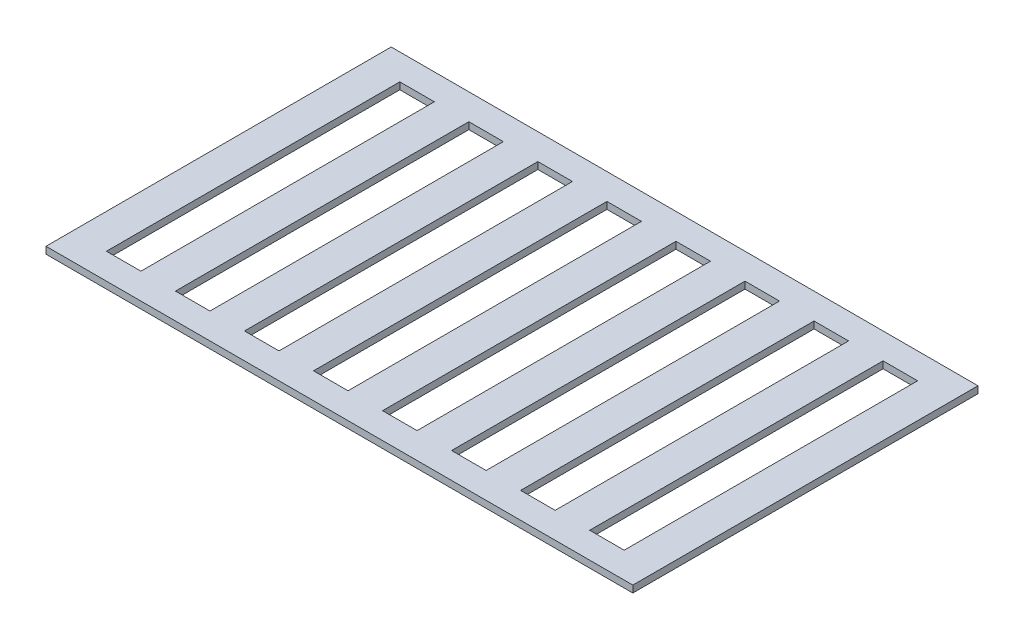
from build123d import *

# Parameters (mm, degrees)
SKETCH1_W           = 431.8
SKETCH1_H           = 254
SKETCH1_W_2         = 25.4
SKETCH1_H_2         = 215.9
BOSS_EXTRUDE1_DEPTH = 5.08


with BuildPart() as part:
    # Sketch1 → Boss-Extrude1 (new body)
    with BuildSketch(Plane(origin=(0, 0, 0), x_dir=(1, 0, 0), z_dir=(0, 1, 0))):
        with Locations((215.9, -127)):
            Rectangle(SKETCH1_W, SKETCH1_H)
        with Locations((88.9, -127)):
            Rectangle(SKETCH1_W_2, SKETCH1_H_2, mode=Mode.SUBTRACT)
        with Locations((38.1, -127)):
            Rectangle(SKETCH1_W_2, SKETCH1_H_2, mode=Mode.SUBTRACT)
        with Locations((393.7, -127)):
            Rectangle(SKETCH1_W_2, SKETCH1_H_2, mode=Mode.SUBTRACT)
        with Locations((139.7, -127)):
            Rectangle(SKETCH1_W_2, SKETCH1_H_2, mode=Mode.SUBTRACT)
        with Locations((190.5, -127)):
            Rectangle(SKETCH1_W_2, SKETCH1_H_2, mode=Mode.SUBTRACT)
        with Locations((241.3, -127)):
            Rectangle(SKETCH1_W_2, SKETCH1_H_2, mode=Mode.SUBTRACT)
        with Locations((292.1, -127)):
            Rectangle(SKETCH1_W_2, SKETCH1_H_2, mode=Mode.SUBTRACT)
        with Locations((342.9, -127)):
            Rectangle(SKETCH1_W_2, SKETCH1_H_2, mode=Mode.SUBTRACT)
    extrude(amount=BOSS_EXTRUDE1_DEPTH)


solid = part.part
